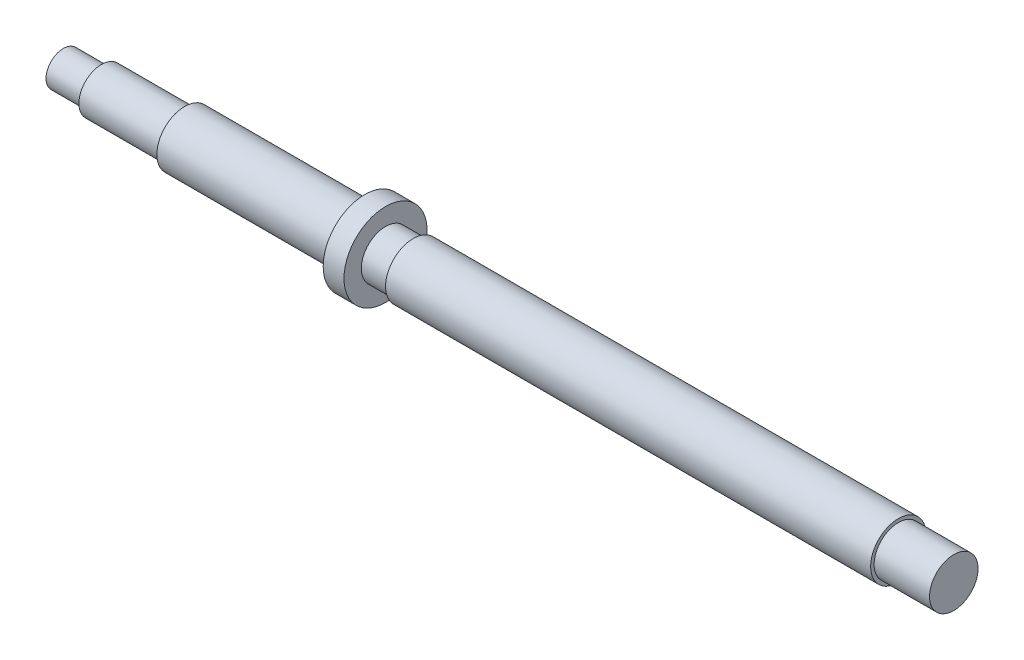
from build123d import *


with BuildPart() as part:
    # Sketch1 → Revolve1 (revolve)
    with BuildSketch(Plane.XY, mode=Mode.PRIVATE) as revolve1_sk:
        Polygon((0, 0), (0, 5), (11, 5), (11, 6.5), (35, 6.5), (35, 8), (87, 8), (87, 12), (93, 12), (93, 7), (101, 7), (101, 8), (241, 8), (241, 7), (257, 7), (257, 0), align=None)
    revolve(revolve1_sk.sketch.rotate(Axis((0, 0, 0), (1, 0, 0)), 90), axis=Axis((0, 0, 0), (1, 0, 0)))


solid = part.part
